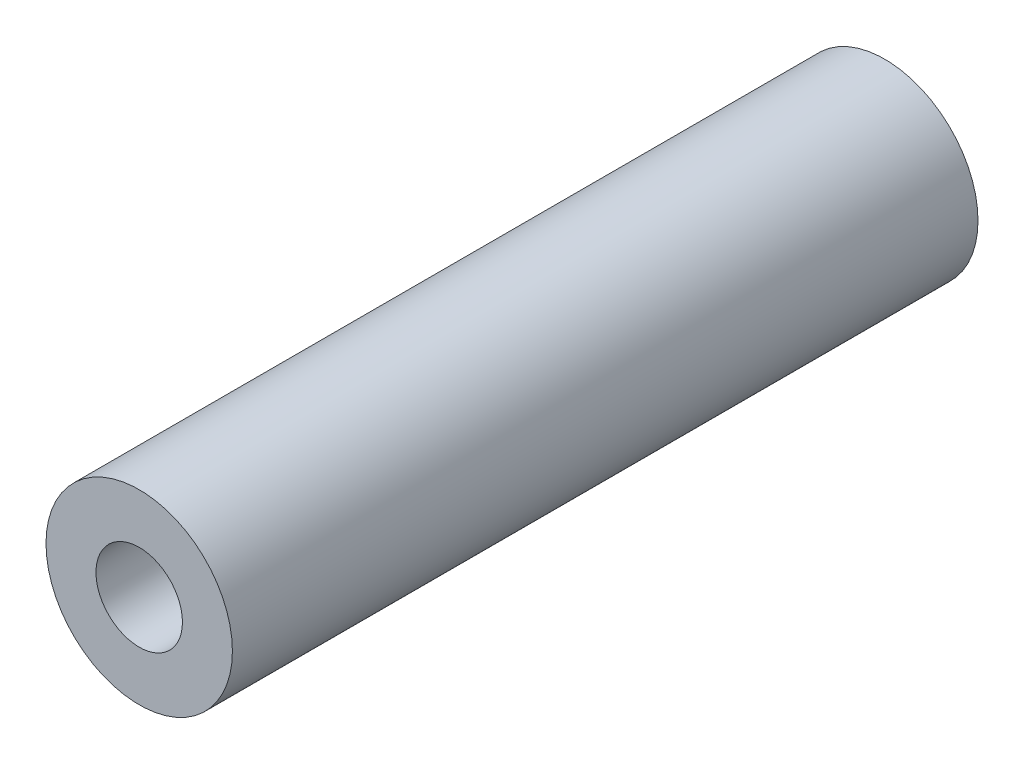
ISO-10303-21;
HEADER;
FILE_DESCRIPTION(('STEP AP214'),'2;1');
FILE_NAME('part.step','',(''),(''),'','','');
FILE_SCHEMA(('AUTOMOTIVE_DESIGN { 1 0 10303 214 1 1 1 1 }'));
ENDSEC;
DATA;
#1=APPLICATION_CONTEXT('core data for automotive mechanical design processes');
#2=APPLICATION_PROTOCOL_DEFINITION('international standard','automotive_design',2000,#1);
#3=PRODUCT_CONTEXT('',#1,'mechanical');
#4=PRODUCT('Part','Part','',(#3));
#5=PRODUCT_RELATED_PRODUCT_CATEGORY('part','',(#4));
#6=PRODUCT_DEFINITION_FORMATION('','',#4);
#7=PRODUCT_DEFINITION_CONTEXT('part definition',#1,'design');
#8=PRODUCT_DEFINITION('design','',#6,#7);
#9=PRODUCT_DEFINITION_SHAPE('','',#8);
#10=(LENGTH_UNIT() NAMED_UNIT(*) SI_UNIT(.MILLI.,.METRE.));
#11=(NAMED_UNIT(*) PLANE_ANGLE_UNIT() SI_UNIT($,.RADIAN.));
#12=(NAMED_UNIT(*) SI_UNIT($,.STERADIAN.) SOLID_ANGLE_UNIT());
#13=UNCERTAINTY_MEASURE_WITH_UNIT(LENGTH_MEASURE(1.E-05),#10,'distance_accuracy_value','');
#14=(GEOMETRIC_REPRESENTATION_CONTEXT(3) GLOBAL_UNCERTAINTY_ASSIGNED_CONTEXT((#13)) GLOBAL_UNIT_ASSIGNED_CONTEXT((#10,
#11,#12)) REPRESENTATION_CONTEXT('',''));
#15=CARTESIAN_POINT('',(0.,0.,0.));
#16=DIRECTION('',(0.,0.,1.));
#17=DIRECTION('',(1.,0.,0.));
#18=AXIS2_PLACEMENT_3D('',#15,#16,#17);
#19=CARTESIAN_POINT('',(0.,0.,25.4));
#20=DIRECTION('',(0.,0.,-1.));
#21=DIRECTION('',(-1.,0.,0.));
#22=AXIS2_PLACEMENT_3D('',#19,#20,#21);
#23=CYLINDRICAL_SURFACE('',#22,3.175);
#24=CARTESIAN_POINT('',(0.,0.,25.4));
#25=DIRECTION('',(0.,0.,1.));
#26=DIRECTION('',(1.,0.,0.));
#27=AXIS2_PLACEMENT_3D('',#24,#25,#26);
#28=CIRCLE('',#27,3.175);
#29=CARTESIAN_POINT('',(3.175,0.,25.4));
#30=VERTEX_POINT('',#29);
#31=EDGE_CURVE('E10',#30,#30,#28,.T.);
#32=ORIENTED_EDGE('',*,*,#31,.F.);
#33=EDGE_LOOP('',(#32));
#34=FACE_BOUND('',#33,.T.);
#35=CARTESIAN_POINT('',(0.,0.,0.));
#36=DIRECTION('',(0.,0.,1.));
#37=DIRECTION('',(1.,0.,0.));
#38=AXIS2_PLACEMENT_3D('',#35,#36,#37);
#39=CIRCLE('',#38,3.175);
#40=CARTESIAN_POINT('',(3.175,0.,0.));
#41=VERTEX_POINT('',#40);
#42=EDGE_CURVE('E33',#41,#41,#39,.T.);
#43=ORIENTED_EDGE('',*,*,#42,.T.);
#44=EDGE_LOOP('',(#43));
#45=FACE_BOUND('',#44,.T.);
#46=ADVANCED_FACE('F30',(#34,#45),#23,.T.);
#47=CARTESIAN_POINT('',(0.,0.,25.4));
#48=DIRECTION('',(0.,0.,1.));
#49=DIRECTION('',(1.,0.,0.));
#50=AXIS2_PLACEMENT_3D('',#47,#48,#49);
#51=PLANE('',#50);
#52=CARTESIAN_POINT('',(0.,0.,25.4));
#53=DIRECTION('',(0.,0.,1.));
#54=DIRECTION('',(1.,0.,0.));
#55=AXIS2_PLACEMENT_3D('',#52,#53,#54);
#56=CIRCLE('',#55,1.47319999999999);
#57=CARTESIAN_POINT('',(1.47319999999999,0.,25.4));
#58=VERTEX_POINT('',#57);
#59=EDGE_CURVE('E44',#58,#58,#56,.T.);
#60=ORIENTED_EDGE('',*,*,#59,.F.);
#61=EDGE_LOOP('',(#60));
#62=FACE_BOUND('',#61,.T.);
#63=ORIENTED_EDGE('',*,*,#31,.T.);
#64=EDGE_LOOP('',(#63));
#65=FACE_BOUND('',#64,.T.);
#66=ADVANCED_FACE('F50',(#62,#65),#51,.T.);
#67=CARTESIAN_POINT('',(0.,0.,0.));
#68=DIRECTION('',(0.,0.,1.));
#69=DIRECTION('',(1.,0.,0.));
#70=AXIS2_PLACEMENT_3D('',#67,#68,#69);
#71=PLANE('',#70);
#72=CARTESIAN_POINT('',(0.,0.,0.));
#73=DIRECTION('',(0.,0.,1.));
#74=DIRECTION('',(1.,0.,0.));
#75=AXIS2_PLACEMENT_3D('',#72,#73,#74);
#76=CIRCLE('',#75,1.47319999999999);
#77=CARTESIAN_POINT('',(1.47319999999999,0.,0.));
#78=VERTEX_POINT('',#77);
#79=EDGE_CURVE('E40',#78,#78,#76,.T.);
#80=ORIENTED_EDGE('',*,*,#79,.T.);
#81=EDGE_LOOP('',(#80));
#82=FACE_BOUND('',#81,.T.);
#83=ORIENTED_EDGE('',*,*,#42,.F.);
#84=EDGE_LOOP('',(#83));
#85=FACE_BOUND('',#84,.T.);
#86=ADVANCED_FACE('F52',(#82,#85),#71,.F.);
#87=CARTESIAN_POINT('',(0.,0.,25.4));
#88=DIRECTION('',(0.,0.,1.));
#89=DIRECTION('',(1.,0.,0.));
#90=AXIS2_PLACEMENT_3D('',#87,#88,#89);
#91=CYLINDRICAL_SURFACE('',#90,1.47319999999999);
#92=ORIENTED_EDGE('',*,*,#79,.F.);
#93=EDGE_LOOP('',(#92));
#94=FACE_BOUND('',#93,.T.);
#95=ORIENTED_EDGE('',*,*,#59,.T.);
#96=EDGE_LOOP('',(#95));
#97=FACE_BOUND('',#96,.T.);
#98=ADVANCED_FACE('F48',(#94,#97),#91,.F.);
#99=CLOSED_SHELL('',(#46,#66,#86,#98));
#100=MANIFOLD_SOLID_BREP('B2',#99);
#101=ADVANCED_BREP_SHAPE_REPRESENTATION('',(#18,#100),#14);
#102=SHAPE_DEFINITION_REPRESENTATION(#9,#101);
ENDSEC;
END-ISO-10303-21;
